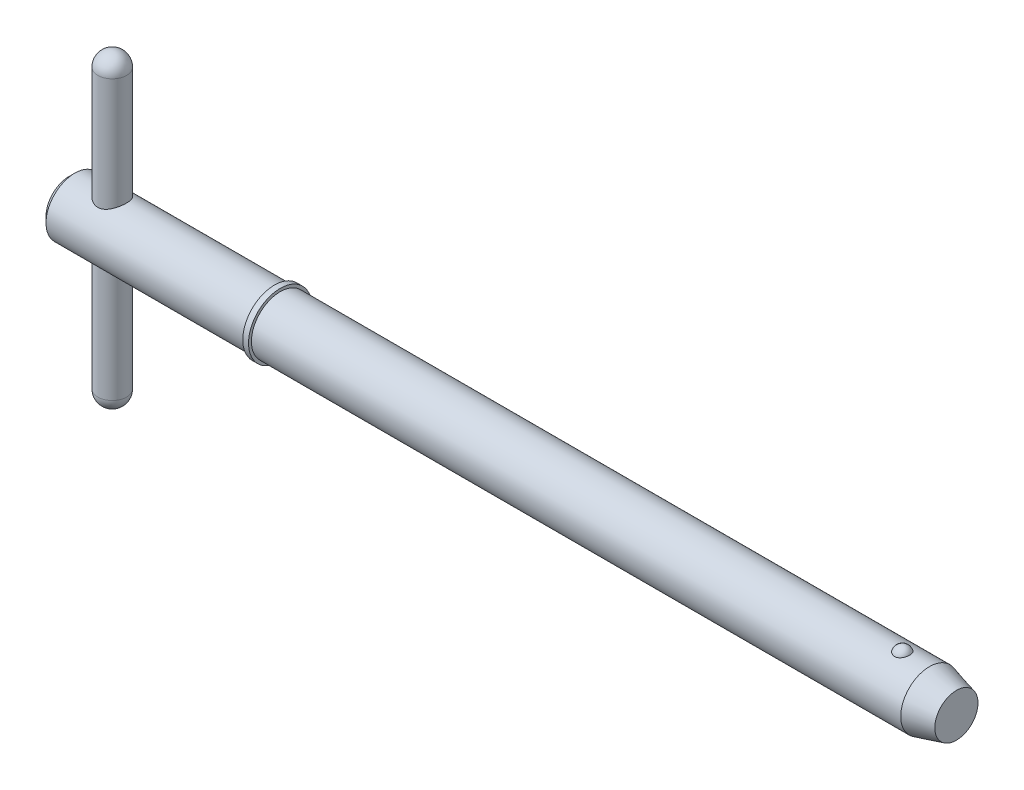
ISO-10303-21;
HEADER;
FILE_DESCRIPTION(('STEP AP214'),'2;1');
FILE_NAME('part.step','',(''),(''),'','','');
FILE_SCHEMA(('AUTOMOTIVE_DESIGN { 1 0 10303 214 1 1 1 1 }'));
ENDSEC;
DATA;
#1=APPLICATION_CONTEXT('core data for automotive mechanical design processes');
#2=APPLICATION_PROTOCOL_DEFINITION('international standard','automotive_design',2000,#1);
#3=PRODUCT_CONTEXT('',#1,'mechanical');
#4=PRODUCT('Part','Part','',(#3));
#5=PRODUCT_RELATED_PRODUCT_CATEGORY('part','',(#4));
#6=PRODUCT_DEFINITION_FORMATION('','',#4);
#7=PRODUCT_DEFINITION_CONTEXT('part definition',#1,'design');
#8=PRODUCT_DEFINITION('design','',#6,#7);
#9=PRODUCT_DEFINITION_SHAPE('','',#8);
#10=(LENGTH_UNIT() NAMED_UNIT(*) SI_UNIT(.MILLI.,.METRE.));
#11=(NAMED_UNIT(*) PLANE_ANGLE_UNIT() SI_UNIT($,.RADIAN.));
#12=(NAMED_UNIT(*) SI_UNIT($,.STERADIAN.) SOLID_ANGLE_UNIT());
#13=UNCERTAINTY_MEASURE_WITH_UNIT(LENGTH_MEASURE(1.E-05),#10,'distance_accuracy_value','');
#14=(GEOMETRIC_REPRESENTATION_CONTEXT(3) GLOBAL_UNCERTAINTY_ASSIGNED_CONTEXT((#13)) GLOBAL_UNIT_ASSIGNED_CONTEXT((#10,
#11,#12)) REPRESENTATION_CONTEXT('',''));
#15=CARTESIAN_POINT('',(0.,0.,0.));
#16=DIRECTION('',(0.,0.,1.));
#17=DIRECTION('',(1.,0.,0.));
#18=AXIS2_PLACEMENT_3D('',#15,#16,#17);
#19=CARTESIAN_POINT('',(3.57,12.7,0.));
#20=DIRECTION('',(0.,-1.,0.));
#21=DIRECTION('',(0.,0.,-1.));
#22=AXIS2_PLACEMENT_3D('',#19,#20,#21);
#23=CYLINDRICAL_SURFACE('',#22,1.19);
#24=CARTESIAN_POINT('',(3.57,-11.51,0.));
#25=DIRECTION('',(0.,-1.,0.));
#26=DIRECTION('',(0.,0.,-1.));
#27=AXIS2_PLACEMENT_3D('',#24,#25,#26);
#28=CIRCLE('',#27,1.19);
#29=CARTESIAN_POINT('',(3.57,-11.51,-1.19));
#30=VERTEX_POINT('',#29);
#31=EDGE_CURVE('P0_E10',#30,#30,#28,.F.);
#32=ORIENTED_EDGE('',*,*,#31,.T.);
#33=EDGE_LOOP('',(#32));
#34=FACE_BOUND('',#33,.T.);
#35=CARTESIAN_POINT('',(3.57,11.51,0.));
#36=DIRECTION('',(0.,-1.,0.));
#37=DIRECTION('',(0.,0.,-1.));
#38=AXIS2_PLACEMENT_3D('',#35,#36,#37);
#39=CIRCLE('',#38,1.19);
#40=CARTESIAN_POINT('',(3.57,11.51,-1.19));
#41=VERTEX_POINT('',#40);
#42=EDGE_CURVE('P0_E21',#41,#41,#39,.T.);
#43=ORIENTED_EDGE('',*,*,#42,.T.);
#44=EDGE_LOOP('',(#43));
#45=FACE_BOUND('',#44,.T.);
#46=ADVANCED_FACE('P0_F14',(#34,#45),#23,.T.);
#47=CARTESIAN_POINT('',(3.57,-11.51,0.));
#48=DIRECTION('',(0.,0.,1.));
#49=DIRECTION('',(1.,0.,0.));
#50=AXIS2_PLACEMENT_3D('',#47,#48,#49);
#51=SPHERICAL_SURFACE('',#50,1.19);
#52=CARTESIAN_POINT('',(3.57,-11.51,0.));
#53=DIRECTION('',(0.,-1.,0.));
#54=DIRECTION('',(0.,0.,-1.));
#55=AXIS2_PLACEMENT_3D('',#52,#53,#54);
#56=SPHERICAL_SURFACE('',#55,1.19);
#57=ORIENTED_EDGE('',*,*,#31,.F.);
#58=EDGE_LOOP('',(#57));
#59=FACE_BOUND('',#58,.T.);
#60=ADVANCED_FACE('P0_F29',(#59),#56,.T.);
#61=CARTESIAN_POINT('',(3.57,11.51,0.));
#62=DIRECTION('',(0.,0.,1.));
#63=DIRECTION('',(1.,0.,0.));
#64=AXIS2_PLACEMENT_3D('',#61,#62,#63);
#65=SPHERICAL_SURFACE('',#64,1.19);
#66=CARTESIAN_POINT('',(3.57,11.51,0.));
#67=DIRECTION('',(0.,-1.,0.));
#68=DIRECTION('',(0.,0.,-1.));
#69=AXIS2_PLACEMENT_3D('',#66,#67,#68);
#70=SPHERICAL_SURFACE('',#69,1.19);
#71=ORIENTED_EDGE('',*,*,#42,.F.);
#72=EDGE_LOOP('',(#71));
#73=FACE_BOUND('',#72,.T.);
#74=ADVANCED_FACE('P0_F16',(#73),#70,.T.);
#75=CLOSED_SHELL('',(#46,#60,#74));
#76=MANIFOLD_SOLID_BREP('P0_B1',#75);
#77=CARTESIAN_POINT('',(0.,0.,0.));
#78=DIRECTION('',(1.,0.,0.));
#79=DIRECTION('',(0.,0.,-1.));
#80=AXIS2_PLACEMENT_3D('',#77,#78,#79);
#81=CYLINDRICAL_SURFACE('',#80,2.38);
#82=CARTESIAN_POINT('',(71.1094297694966,0.,0.));
#83=DIRECTION('',(1.,0.,0.));
#84=DIRECTION('',(0.,0.,-1.));
#85=AXIS2_PLACEMENT_3D('',#82,#83,#84);
#86=CIRCLE('',#85,2.38);
#87=CARTESIAN_POINT('',(71.1094297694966,0.,-2.38));
#88=VERTEX_POINT('',#87);
#89=EDGE_CURVE('P1_E81',#88,#88,#86,.T.);
#90=ORIENTED_EDGE('',*,*,#89,.F.);
#91=EDGE_LOOP('',(#90));
#92=FACE_BOUND('',#91,.T.);
#93=CARTESIAN_POINT('',(17.45,0.,0.));
#94=DIRECTION('',(1.,0.,0.));
#95=DIRECTION('',(0.,0.,-1.));
#96=AXIS2_PLACEMENT_3D('',#93,#94,#95);
#97=CIRCLE('',#96,2.38);
#98=CARTESIAN_POINT('',(17.45,0.,-2.38));
#99=VERTEX_POINT('',#98);
#100=EDGE_CURVE('P1_E85',#99,#99,#97,.T.);
#101=ORIENTED_EDGE('',*,*,#100,.T.);
#102=EDGE_LOOP('',(#101));
#103=FACE_BOUND('',#102,.T.);
#104=CARTESIAN_POINT('',(68.8634492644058,2.2921568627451,0.640637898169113));
#105=CARTESIAN_POINT('',(68.8303559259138,2.29215737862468,0.64063719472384));
#106=CARTESIAN_POINT('',(68.7972546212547,2.29293179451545,0.637884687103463));
#107=CARTESIAN_POINT('',(68.7320176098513,2.29594030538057,0.626968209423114));
#108=CARTESIAN_POINT('',(68.6998823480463,2.29817506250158,0.618801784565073));
#109=CARTESIAN_POINT('',(68.6375402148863,2.3038430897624,0.597351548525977));
#110=CARTESIAN_POINT('',(68.6073305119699,2.30727454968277,0.584075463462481));
#111=CARTESIAN_POINT('',(68.5495674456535,2.31495941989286,0.552829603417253));
#112=CARTESIAN_POINT('',(68.5220141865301,2.31921286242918,0.534859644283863));
#113=CARTESIAN_POINT('',(68.4695938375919,2.32820213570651,0.494282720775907));
#114=CARTESIAN_POINT('',(68.4448050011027,2.33294694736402,0.471576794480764));
#115=CARTESIAN_POINT('',(68.3992169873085,2.34234144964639,0.422446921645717));
#116=CARTESIAN_POINT('',(68.3784185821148,2.34699112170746,0.396022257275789));
#117=CARTESIAN_POINT('',(68.3403580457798,2.35593942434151,0.338855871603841));
#118=CARTESIAN_POINT('',(68.3233051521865,2.36021170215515,0.307970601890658));
#119=CARTESIAN_POINT('',(68.2943607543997,2.3677057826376,0.243750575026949));
#120=CARTESIAN_POINT('',(68.2824701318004,2.37092740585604,0.210415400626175));
#121=CARTESIAN_POINT('',(68.2638076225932,2.37606901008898,0.141189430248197));
#122=CARTESIAN_POINT('',(68.2571956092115,2.37794816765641,0.105252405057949));
#123=CARTESIAN_POINT('',(68.2498095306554,2.38005135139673,0.032735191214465));
#124=CARTESIAN_POINT('',(68.2490358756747,2.38027526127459,-0.00384504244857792));
#125=CARTESIAN_POINT('',(68.2533628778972,2.37903842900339,-0.0769838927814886));
#126=CARTESIAN_POINT('',(68.2585202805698,2.37756141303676,-0.113538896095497));
#127=CARTESIAN_POINT('',(68.2747013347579,2.37305303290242,-0.185229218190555));
#128=CARTESIAN_POINT('',(68.2857251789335,2.37002161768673,-0.220364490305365));
#129=CARTESIAN_POINT('',(68.3133977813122,2.36273722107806,-0.288156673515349));
#130=CARTESIAN_POINT('',(68.3300389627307,2.35848588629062,-0.320816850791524));
#131=CARTESIAN_POINT('',(68.3685984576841,2.34923130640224,-0.382744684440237));
#132=CARTESIAN_POINT('',(68.390516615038,2.34422808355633,-0.412012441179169));
#133=CARTESIAN_POINT('',(68.4387549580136,2.33412555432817,-0.465830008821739));
#134=CARTESIAN_POINT('',(68.465002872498,2.32902887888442,-0.490444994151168));
#135=CARTESIAN_POINT('',(68.5214769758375,2.31926941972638,-0.534700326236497));
#136=CARTESIAN_POINT('',(68.551702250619,2.3146065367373,-0.554341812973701));
#137=CARTESIAN_POINT('',(68.6140618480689,2.30645675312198,-0.587312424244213));
#138=CARTESIAN_POINT('',(68.6460780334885,2.30293152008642,-0.600855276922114));
#139=CARTESIAN_POINT('',(68.7120795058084,2.29725171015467,-0.622220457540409));
#140=CARTESIAN_POINT('',(68.7460641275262,2.29509667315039,-0.630044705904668));
#141=CARTESIAN_POINT('',(68.813299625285,2.29249264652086,-0.639452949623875));
#142=CARTESIAN_POINT('',(68.8465087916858,2.29196755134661,-0.641315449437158));
#143=CARTESIAN_POINT('',(68.912763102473,2.29246849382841,-0.63952261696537));
#144=CARTESIAN_POINT('',(68.9458082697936,2.29349430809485,-0.635868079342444));
#145=CARTESIAN_POINT('',(69.0101025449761,2.29694059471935,-0.623301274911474));
#146=CARTESIAN_POINT('',(69.0413744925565,2.29933234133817,-0.614497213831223));
#147=CARTESIAN_POINT('',(69.1019952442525,2.30522511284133,-0.592006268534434));
#148=CARTESIAN_POINT('',(69.1313438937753,2.30872622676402,-0.578318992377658));
#149=CARTESIAN_POINT('',(69.1880369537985,2.31655795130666,-0.546112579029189));
#150=CARTESIAN_POINT('',(69.215320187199,2.32090569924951,-0.52749010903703));
#151=CARTESIAN_POINT('',(69.2664904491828,2.3299220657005,-0.486117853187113));
#152=CARTESIAN_POINT('',(69.2903767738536,2.33459075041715,-0.463367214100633));
#153=CARTESIAN_POINT('',(69.3352722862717,2.34399834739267,-0.413220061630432));
#154=CARTESIAN_POINT('',(69.3560972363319,2.34873051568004,-0.385657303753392));
#155=CARTESIAN_POINT('',(69.393056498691,2.35754932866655,-0.327455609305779));
#156=CARTESIAN_POINT('',(69.4091898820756,2.36163584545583,-0.296816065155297));
#157=CARTESIAN_POINT('',(69.4369822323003,2.36889321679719,-0.23204704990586));
#158=CARTESIAN_POINT('',(69.4484450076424,2.37202275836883,-0.197828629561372));
#159=CARTESIAN_POINT('',(69.4657523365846,2.37681926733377,-0.127900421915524));
#160=CARTESIAN_POINT('',(69.4715962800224,2.37848607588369,-0.0921904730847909));
#161=CARTESIAN_POINT('',(69.477605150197,2.38020024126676,-0.0196348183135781));
#162=CARTESIAN_POINT('',(69.4776704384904,2.38021918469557,0.0172198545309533));
#163=CARTESIAN_POINT('',(69.4718689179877,2.37856356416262,0.0904219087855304));
#164=CARTESIAN_POINT('',(69.4660018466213,2.37688892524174,0.126769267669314));
#165=CARTESIAN_POINT('',(69.448425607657,2.37201688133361,0.198028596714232));
#166=CARTESIAN_POINT('',(69.4366998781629,2.36881516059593,0.232936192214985));
#167=CARTESIAN_POINT('',(69.4076354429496,2.36123444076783,0.300196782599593));
#168=CARTESIAN_POINT('',(69.3902967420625,2.3568554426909,0.332549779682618));
#169=CARTESIAN_POINT('',(69.3505350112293,2.34744667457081,0.39349541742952));
#170=CARTESIAN_POINT('',(69.3281528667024,2.34242227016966,0.422115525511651));
#171=CARTESIAN_POINT('',(69.2787391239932,2.33227293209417,0.475004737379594));
#172=CARTESIAN_POINT('',(69.2517076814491,2.32714800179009,0.499273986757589));
#173=CARTESIAN_POINT('',(69.1944988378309,2.31755359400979,0.542046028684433));
#174=CARTESIAN_POINT('',(69.1644297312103,2.3130698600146,0.560690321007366));
#175=CARTESIAN_POINT('',(69.1013869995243,2.30514125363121,0.592447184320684));
#176=CARTESIAN_POINT('',(69.0684158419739,2.30169550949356,0.605564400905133));
#177=CARTESIAN_POINT('',(69.0068424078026,2.29677744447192,0.623927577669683));
#178=CARTESIAN_POINT('',(68.9785555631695,2.295058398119,0.630178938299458));
#179=CARTESIAN_POINT('',(68.9213308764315,2.29274795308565,0.638534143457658));
#180=CARTESIAN_POINT('',(68.8923931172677,2.29215641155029,0.640638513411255));
#181=CARTESIAN_POINT('',(68.8634492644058,2.2921568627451,0.640637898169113));
#182=B_SPLINE_CURVE_WITH_KNOTS('',3,(#104,#105,#106,#107,#108,#109,#110,#111,#112,#113,#114,
#115,#116,#117,#118,#119,#120,#121,#122,#123,#124,#125,#126,#127,#128,#129,#130,#131,#132,#133,
#134,#135,#136,#137,#138,#139,#140,#141,#142,#143,#144,#145,#146,#147,#148,#149,#150,#151,#152,
#153,#154,#155,#156,#157,#158,#159,#160,#161,#162,#163,#164,#165,#166,#167,#168,#169,#170,#171,
#172,#173,#174,#175,#176,#177,#178,#179,#180,#181),.UNSPECIFIED.,.T.,.F.,(4,2,2,2,2,2,2,2,2,2,2,
2,2,2,2,2,2,2,2,2,2,2,2,2,2,2,2,2,2,2,2,2,2,2,2,2,2,2,4),(0.,0.0991724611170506,
0.198389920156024,0.297457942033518,0.396529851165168,0.497927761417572,0.59934527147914,
0.70547553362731,0.811623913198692,0.920876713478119,1.03013718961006,1.14045177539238,
1.25076998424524,1.36093998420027,1.47110672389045,1.57959248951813,1.68805336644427,
1.79234266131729,1.89659691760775,1.9959039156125,2.09519661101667,2.19247425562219,
2.2897597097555,2.38926978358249,2.48880044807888,2.59293588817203,2.69709193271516,
2.80525821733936,2.91343624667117,3.0234791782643,3.13352698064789,3.24388765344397,
3.35424823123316,3.46374443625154,3.57323697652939,3.67968690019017,3.78604717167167,
3.87279565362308,3.9595331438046),.UNSPECIFIED.);
#183=CARTESIAN_POINT('',(68.8634492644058,2.2921568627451,0.640637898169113));
#184=VERTEX_POINT('',#183);
#185=EDGE_CURVE('P1_E35',#184,#184,#182,.T.);
#186=ORIENTED_EDGE('',*,*,#185,.T.);
#187=EDGE_LOOP('',(#186));
#188=FACE_BOUND('',#187,.T.);
#189=ADVANCED_FACE('P1_F13',(#92,#103,#188),#81,.T.);
#190=CARTESIAN_POINT('',(0.,0.,0.));
#191=DIRECTION('',(-1.,0.,0.));
#192=DIRECTION('',(0.,0.,1.));
#193=AXIS2_PLACEMENT_3D('',#190,#191,#192);
#194=PLANE('',#193);
#195=CARTESIAN_POINT('',(0.,0.,0.));
#196=DIRECTION('',(1.,0.,0.));
#197=DIRECTION('',(0.,0.,-1.));
#198=AXIS2_PLACEMENT_3D('',#195,#196,#197);
#199=CIRCLE('',#198,1.904);
#200=CARTESIAN_POINT('',(0.,0.,-1.904));
#201=VERTEX_POINT('',#200);
#202=EDGE_CURVE('P1_E9',#201,#201,#199,.T.);
#203=ORIENTED_EDGE('',*,*,#202,.F.);
#204=EDGE_LOOP('',(#203));
#205=FACE_BOUND('',#204,.T.);
#206=ADVANCED_FACE('P1_F15',(#205),#194,.T.);
#207=CARTESIAN_POINT('',(0.475999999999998,0.,0.));
#208=DIRECTION('',(1.,0.,0.));
#209=DIRECTION('',(0.,0.,-1.));
#210=AXIS2_PLACEMENT_3D('',#207,#208,#209);
#211=CONICAL_SURFACE('',#210,2.38,0.78539816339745);
#212=ORIENTED_EDGE('',*,*,#202,.T.);
#213=EDGE_LOOP('',(#212));
#214=FACE_BOUND('',#213,.T.);
#215=CARTESIAN_POINT('',(0.475999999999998,0.,0.));
#216=DIRECTION('',(1.,0.,0.));
#217=DIRECTION('',(0.,0.,-1.));
#218=AXIS2_PLACEMENT_3D('',#215,#216,#217);
#219=CIRCLE('',#218,2.38);
#220=CARTESIAN_POINT('',(0.475999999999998,0.,-2.38));
#221=VERTEX_POINT('',#220);
#222=EDGE_CURVE('P1_E26',#221,#221,#219,.T.);
#223=ORIENTED_EDGE('',*,*,#222,.F.);
#224=EDGE_LOOP('',(#223));
#225=FACE_BOUND('',#224,.T.);
#226=ADVANCED_FACE('P1_F77',(#214,#225),#211,.T.);
#227=CARTESIAN_POINT('',(0.,0.,0.));
#228=DIRECTION('',(1.,0.,0.));
#229=DIRECTION('',(0.,0.,-1.));
#230=AXIS2_PLACEMENT_3D('',#227,#228,#229);
#231=CYLINDRICAL_SURFACE('',#230,2.38);
#232=CARTESIAN_POINT('',(3.57,-2.06114046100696,1.19));
#233=CARTESIAN_POINT('',(3.50799170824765,-2.06114586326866,1.18999567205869));
#234=CARTESIAN_POINT('',(3.4459051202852,-2.0639812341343,1.18512096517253));
#235=CARTESIAN_POINT('',(3.32363755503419,-2.07491216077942,1.16587061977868));
#236=CARTESIAN_POINT('',(3.26346086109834,-2.08301876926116,1.15147501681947));
#237=CARTESIAN_POINT('',(3.14701251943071,-2.10331722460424,1.11395893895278));
#238=CARTESIAN_POINT('',(3.09072196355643,-2.1154873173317,1.09088484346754));
#239=CARTESIAN_POINT('',(2.9828251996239,-2.14250771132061,1.03680835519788));
#240=CARTESIAN_POINT('',(2.93121924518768,-2.15735815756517,1.00580553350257));
#241=CARTESIAN_POINT('',(2.82945618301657,-2.18956274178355,0.933753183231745));
#242=CARTESIAN_POINT('',(2.77976962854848,-2.20702235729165,0.892085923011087));
#243=CARTESIAN_POINT('',(2.68772401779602,-2.2416265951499,0.801172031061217));
#244=CARTESIAN_POINT('',(2.64536861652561,-2.25877105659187,0.751921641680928));
#245=CARTESIAN_POINT('',(2.56639309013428,-2.29219557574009,0.64318258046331));
#246=CARTESIAN_POINT('',(2.53035201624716,-2.30833946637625,0.583227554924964));
#247=CARTESIAN_POINT('',(2.46908238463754,-2.3365739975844,0.45714686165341));
#248=CARTESIAN_POINT('',(2.44384700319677,-2.34866719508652,0.391025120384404));
#249=CARTESIAN_POINT('',(2.40676945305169,-2.36667748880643,0.259473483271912));
#250=CARTESIAN_POINT('',(2.39410206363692,-2.37297281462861,0.194329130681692));
#251=CARTESIAN_POINT('',(2.3798023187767,-2.3800902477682,0.0625590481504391));
#252=CARTESIAN_POINT('',(2.37816328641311,-2.38091566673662,-0.00406576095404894));
#253=CARTESIAN_POINT('',(2.38564854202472,-2.37717948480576,-0.130700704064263));
#254=CARTESIAN_POINT('',(2.39384923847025,-2.37308010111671,-0.190782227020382));
#255=CARTESIAN_POINT('',(2.41912820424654,-2.360653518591,-0.308583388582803));
#256=CARTESIAN_POINT('',(2.43620713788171,-2.35232600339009,-0.366302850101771));
#257=CARTESIAN_POINT('',(2.47886825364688,-2.33206184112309,-0.478748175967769));
#258=CARTESIAN_POINT('',(2.50456481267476,-2.32007685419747,-0.533421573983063));
#259=CARTESIAN_POINT('',(2.56357346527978,-2.29357798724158,-0.637812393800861));
#260=CARTESIAN_POINT('',(2.5968882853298,-2.27906320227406,-0.687528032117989));
#261=CARTESIAN_POINT('',(2.67380546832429,-2.24724829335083,-0.785606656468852));
#262=CARTESIAN_POINT('',(2.71808260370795,-2.22981457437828,-0.833397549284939));
#263=CARTESIAN_POINT('',(2.81386177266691,-2.19500665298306,-0.921184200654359));
#264=CARTESIAN_POINT('',(2.86536931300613,-2.17763250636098,-0.961173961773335));
#265=CARTESIAN_POINT('',(2.97815134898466,-2.14371545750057,-1.03471134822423));
#266=CARTESIAN_POINT('',(3.03983836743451,-2.12729540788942,-1.06768860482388));
#267=CARTESIAN_POINT('',(3.16889582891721,-2.09886785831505,-1.12254974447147));
#268=CARTESIAN_POINT('',(3.2362602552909,-2.0868557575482,-1.14444520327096));
#269=CARTESIAN_POINT('',(3.36914526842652,-2.06994116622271,-1.1747444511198));
#270=CARTESIAN_POINT('',(3.43438893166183,-2.06455070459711,-1.18407989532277));
#271=CARTESIAN_POINT('',(3.56571759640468,-2.06010324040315,-1.1918051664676));
#272=CARTESIAN_POINT('',(3.63180197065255,-2.06104176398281,-1.19020272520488));
#273=CARTESIAN_POINT('',(3.75522816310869,-2.06862860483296,-1.17695289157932));
#274=CARTESIAN_POINT('',(3.81273554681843,-2.07464109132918,-1.16642350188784));
#275=CARTESIAN_POINT('',(3.92505766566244,-2.09075885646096,-1.1372785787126));
#276=CARTESIAN_POINT('',(3.97987152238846,-2.1008654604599,-1.1186604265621));
#277=CARTESIAN_POINT('',(4.08813948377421,-2.12458104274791,-1.07296063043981));
#278=CARTESIAN_POINT('',(4.14141303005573,-2.13833055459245,-1.04552693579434));
#279=CARTESIAN_POINT('',(4.2429084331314,-2.16765782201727,-0.983281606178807));
#280=CARTESIAN_POINT('',(4.29112767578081,-2.18323651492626,-0.948466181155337));
#281=CARTESIAN_POINT('',(4.38750473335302,-2.2168271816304,-0.867316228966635));
#282=CARTESIAN_POINT('',(4.43488860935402,-2.23489833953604,-0.82008287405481));
#283=CARTESIAN_POINT('',(4.52130056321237,-2.26973739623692,-0.718051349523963));
#284=CARTESIAN_POINT('',(4.56032581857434,-2.28650485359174,-0.663250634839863));
#285=CARTESIAN_POINT('',(4.62978273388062,-2.31742220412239,-0.545657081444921));
#286=CARTESIAN_POINT('',(4.65996041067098,-2.33149133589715,-0.482691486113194));
#287=CARTESIAN_POINT('',(4.7089941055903,-2.35481192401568,-0.351671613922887));
#288=CARTESIAN_POINT('',(4.7278600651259,-2.36406760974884,-0.283621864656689));
#289=CARTESIAN_POINT('',(4.75210859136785,-2.3760433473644,-0.151105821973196));
#290=CARTESIAN_POINT('',(4.75856947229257,-2.37928514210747,-0.0868836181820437));
#291=CARTESIAN_POINT('',(4.76100348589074,-2.38050135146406,0.0417999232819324));
#292=CARTESIAN_POINT('',(4.75698028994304,-2.37847760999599,0.106261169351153));
#293=CARTESIAN_POINT('',(4.73927447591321,-2.36969422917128,0.229120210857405));
#294=CARTESIAN_POINT('',(4.72624582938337,-2.36325544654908,0.287637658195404));
#295=CARTESIAN_POINT('',(4.69178087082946,-2.34658591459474,0.401560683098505));
#296=CARTESIAN_POINT('',(4.67034335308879,-2.33635462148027,0.456965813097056));
#297=CARTESIAN_POINT('',(4.61871480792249,-2.31247857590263,0.565753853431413));
#298=CARTESIAN_POINT('',(4.58818860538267,-2.29870654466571,0.618948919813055));
#299=CARTESIAN_POINT('',(4.51967006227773,-2.26918878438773,0.719681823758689));
#300=CARTESIAN_POINT('',(4.48167429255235,-2.25344215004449,0.76721704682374));
#301=CARTESIAN_POINT('',(4.39491140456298,-2.21969046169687,0.860267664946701));
#302=CARTESIAN_POINT('',(4.34544863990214,-2.20161660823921,0.905111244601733));
#303=CARTESIAN_POINT('',(4.23943364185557,-2.16655060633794,0.986109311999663));
#304=CARTESIAN_POINT('',(4.18287520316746,-2.1495594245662,1.02225611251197));
#305=CARTESIAN_POINT('',(4.06190239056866,-2.1181953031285,1.08579298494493));
#306=CARTESIAN_POINT('',(3.9972962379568,-2.10392207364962,1.11287022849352));
#307=CARTESIAN_POINT('',(3.86353443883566,-2.08090726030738,1.15534566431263));
#308=CARTESIAN_POINT('',(3.7943948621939,-2.07214719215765,1.17078291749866));
#309=CARTESIAN_POINT('',(3.69875162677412,-2.06499834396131,1.18329673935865));
#310=CARTESIAN_POINT('',(3.67309220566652,-2.06355673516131,1.18580656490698));
#311=CARTESIAN_POINT('',(3.62162638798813,-2.06162663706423,1.18915915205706));
#312=CARTESIAN_POINT('',(3.59581998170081,-2.0611382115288,1.19000180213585));
#313=CARTESIAN_POINT('',(3.57,-2.06114046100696,1.19));
#314=B_SPLINE_CURVE_WITH_KNOTS('',3,(#232,#233,#234,#235,#236,#237,#238,#239,#240,#241,#242,
#243,#244,#245,#246,#247,#248,#249,#250,#251,#252,#253,#254,#255,#256,#257,#258,#259,#260,#261,
#262,#263,#264,#265,#266,#267,#268,#269,#270,#271,#272,#273,#274,#275,#276,#277,#278,#279,#280,
#281,#282,#283,#284,#285,#286,#287,#288,#289,#290,#291,#292,#293,#294,#295,#296,#297,#298,#299,
#300,#301,#302,#303,#304,#305,#306,#307,#308,#309,#310,#311,#312,#313),.UNSPECIFIED.,.T.,.F.,(4,
2,2,2,2,2,2,2,2,2,2,2,2,2,2,2,2,2,2,2,2,2,2,2,2,2,2,2,2,2,2,2,2,2,2,2,2,2,2,2,4),(0.,
0.185916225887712,0.372223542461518,0.557549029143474,0.742884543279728,0.943506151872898,
1.14422749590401,1.35847891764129,1.5725948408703,1.77147547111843,1.97023568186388,
2.15171156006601,2.33320101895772,2.51720146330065,2.70126786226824,2.902733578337,
3.10435357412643,3.31877721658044,3.53297641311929,3.73020126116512,3.92728670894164,
4.1028127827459,4.27839572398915,4.46211082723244,4.64592048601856,4.8529002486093,
5.0599497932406,5.27246375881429,5.48479067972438,5.67763601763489,5.87041383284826,
6.05048865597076,6.23058930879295,6.41839293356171,6.60628297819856,6.8128718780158,
7.01964271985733,7.2329479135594,7.44553408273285,7.52294360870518,7.60035831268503),.UNSPECIFIED.);
#315=CARTESIAN_POINT('',(3.57,-2.06114046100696,1.19));
#316=VERTEX_POINT('',#315);
#317=EDGE_CURVE('P1_E17',#316,#316,#314,.T.);
#318=ORIENTED_EDGE('',*,*,#317,.F.);
#319=EDGE_LOOP('',(#318));
#320=FACE_BOUND('',#319,.T.);
#321=CARTESIAN_POINT('',(3.57,2.06114046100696,1.19));
#322=CARTESIAN_POINT('',(3.63200829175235,2.06114586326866,1.18999567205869));
#323=CARTESIAN_POINT('',(3.6940948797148,2.0639812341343,1.18512096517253));
#324=CARTESIAN_POINT('',(3.81636244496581,2.07491216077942,1.16587061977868));
#325=CARTESIAN_POINT('',(3.87653913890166,2.08301876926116,1.15147501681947));
#326=CARTESIAN_POINT('',(3.99298748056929,2.10331722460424,1.11395893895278));
#327=CARTESIAN_POINT('',(4.04927803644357,2.1154873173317,1.09088484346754));
#328=CARTESIAN_POINT('',(4.1571748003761,2.14250771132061,1.03680835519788));
#329=CARTESIAN_POINT('',(4.20878075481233,2.15735815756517,1.00580553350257));
#330=CARTESIAN_POINT('',(4.31054381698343,2.18956274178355,0.933753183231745));
#331=CARTESIAN_POINT('',(4.36023037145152,2.20702235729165,0.892085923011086));
#332=CARTESIAN_POINT('',(4.45227598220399,2.2416265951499,0.801172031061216));
#333=CARTESIAN_POINT('',(4.49463138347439,2.25877105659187,0.751921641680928));
#334=CARTESIAN_POINT('',(4.57360690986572,2.29219557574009,0.643182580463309));
#335=CARTESIAN_POINT('',(4.60964798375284,2.30833946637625,0.583227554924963));
#336=CARTESIAN_POINT('',(4.67091761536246,2.3365739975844,0.457146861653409));
#337=CARTESIAN_POINT('',(4.69615299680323,2.34866719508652,0.391025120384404));
#338=CARTESIAN_POINT('',(4.73323054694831,2.36667748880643,0.259473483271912));
#339=CARTESIAN_POINT('',(4.74589793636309,2.37297281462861,0.194329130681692));
#340=CARTESIAN_POINT('',(4.7601976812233,2.3800902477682,0.0625590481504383));
#341=CARTESIAN_POINT('',(4.76183671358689,2.38091566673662,-0.00406576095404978));
#342=CARTESIAN_POINT('',(4.75435145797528,2.37717948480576,-0.130700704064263));
#343=CARTESIAN_POINT('',(4.74615076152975,2.37308010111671,-0.190782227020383));
#344=CARTESIAN_POINT('',(4.72087179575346,2.360653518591,-0.308583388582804));
#345=CARTESIAN_POINT('',(4.70379286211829,2.35232600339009,-0.366302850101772));
#346=CARTESIAN_POINT('',(4.66113174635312,2.33206184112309,-0.478748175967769));
#347=CARTESIAN_POINT('',(4.63543518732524,2.32007685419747,-0.533421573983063));
#348=CARTESIAN_POINT('',(4.57642653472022,2.29357798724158,-0.637812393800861));
#349=CARTESIAN_POINT('',(4.5431117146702,2.27906320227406,-0.687528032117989));
#350=CARTESIAN_POINT('',(4.46619453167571,2.24724829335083,-0.785606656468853));
#351=CARTESIAN_POINT('',(4.42191739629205,2.22981457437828,-0.83339754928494));
#352=CARTESIAN_POINT('',(4.32613822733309,2.19500665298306,-0.921184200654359));
#353=CARTESIAN_POINT('',(4.27463068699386,2.17763250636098,-0.961173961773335));
#354=CARTESIAN_POINT('',(4.16184865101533,2.14371545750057,-1.03471134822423));
#355=CARTESIAN_POINT('',(4.10016163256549,2.12729540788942,-1.06768860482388));
#356=CARTESIAN_POINT('',(3.97110417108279,2.09886785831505,-1.12254974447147));
#357=CARTESIAN_POINT('',(3.9037397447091,2.0868557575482,-1.14444520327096));
#358=CARTESIAN_POINT('',(3.77085473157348,2.06994116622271,-1.1747444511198));
#359=CARTESIAN_POINT('',(3.70561106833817,2.06455070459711,-1.18407989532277));
#360=CARTESIAN_POINT('',(3.57428240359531,2.06010324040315,-1.1918051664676));
#361=CARTESIAN_POINT('',(3.50819802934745,2.06104176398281,-1.19020272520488));
#362=CARTESIAN_POINT('',(3.38477183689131,2.06862860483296,-1.17695289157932));
#363=CARTESIAN_POINT('',(3.32726445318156,2.07464109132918,-1.16642350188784));
#364=CARTESIAN_POINT('',(3.21494233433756,2.09075885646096,-1.1372785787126));
#365=CARTESIAN_POINT('',(3.16012847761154,2.1008654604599,-1.1186604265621));
#366=CARTESIAN_POINT('',(3.05186051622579,2.12458104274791,-1.07296063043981));
#367=CARTESIAN_POINT('',(2.99858696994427,2.13833055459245,-1.04552693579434));
#368=CARTESIAN_POINT('',(2.8970915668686,2.16765782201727,-0.983281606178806));
#369=CARTESIAN_POINT('',(2.84887232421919,2.18323651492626,-0.948466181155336));
#370=CARTESIAN_POINT('',(2.75249526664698,2.2168271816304,-0.867316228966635));
#371=CARTESIAN_POINT('',(2.70511139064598,2.23489833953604,-0.820082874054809));
#372=CARTESIAN_POINT('',(2.61869943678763,2.26973739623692,-0.718051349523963));
#373=CARTESIAN_POINT('',(2.57967418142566,2.28650485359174,-0.663250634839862));
#374=CARTESIAN_POINT('',(2.51021726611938,2.31742220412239,-0.54565708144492));
#375=CARTESIAN_POINT('',(2.48003958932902,2.33149133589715,-0.482691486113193));
#376=CARTESIAN_POINT('',(2.4310058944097,2.35481192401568,-0.351671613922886));
#377=CARTESIAN_POINT('',(2.4121399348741,2.36406760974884,-0.283621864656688));
#378=CARTESIAN_POINT('',(2.38789140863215,2.3760433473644,-0.151105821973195));
#379=CARTESIAN_POINT('',(2.38143052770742,2.37928514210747,-0.0868836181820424));
#380=CARTESIAN_POINT('',(2.37899651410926,2.38050135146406,0.0417999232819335));
#381=CARTESIAN_POINT('',(2.38301971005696,2.37847760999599,0.106261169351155));
#382=CARTESIAN_POINT('',(2.40072552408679,2.36969422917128,0.229120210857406));
#383=CARTESIAN_POINT('',(2.41375417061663,2.36325544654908,0.287637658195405));
#384=CARTESIAN_POINT('',(2.44821912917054,2.34658591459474,0.401560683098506));
#385=CARTESIAN_POINT('',(2.46965664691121,2.33635462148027,0.456965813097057));
#386=CARTESIAN_POINT('',(2.52128519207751,2.31247857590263,0.565753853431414));
#387=CARTESIAN_POINT('',(2.55181139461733,2.29870654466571,0.618948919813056));
#388=CARTESIAN_POINT('',(2.62032993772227,2.26918878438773,0.719681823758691));
#389=CARTESIAN_POINT('',(2.65832570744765,2.25344215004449,0.767217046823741));
#390=CARTESIAN_POINT('',(2.74508859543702,2.21969046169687,0.860267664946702));
#391=CARTESIAN_POINT('',(2.79455136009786,2.20161660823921,0.905111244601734));
#392=CARTESIAN_POINT('',(2.90056635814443,2.16655060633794,0.986109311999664));
#393=CARTESIAN_POINT('',(2.95712479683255,2.1495594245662,1.02225611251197));
#394=CARTESIAN_POINT('',(3.07809760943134,2.1181953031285,1.08579298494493));
#395=CARTESIAN_POINT('',(3.1427037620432,2.10392207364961,1.11287022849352));
#396=CARTESIAN_POINT('',(3.27646556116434,2.08090726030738,1.15534566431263));
#397=CARTESIAN_POINT('',(3.3456051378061,2.07214719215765,1.17078291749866));
#398=CARTESIAN_POINT('',(3.44124837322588,2.06499834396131,1.18329673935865));
#399=CARTESIAN_POINT('',(3.46690779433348,2.06355673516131,1.18580656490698));
#400=CARTESIAN_POINT('',(3.51837361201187,2.06162663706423,1.18915915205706));
#401=CARTESIAN_POINT('',(3.54418001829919,2.0611382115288,1.19000180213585));
#402=CARTESIAN_POINT('',(3.57,2.06114046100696,1.19));
#403=B_SPLINE_CURVE_WITH_KNOTS('',3,(#321,#322,#323,#324,#325,#326,#327,#328,#329,#330,#331,
#332,#333,#334,#335,#336,#337,#338,#339,#340,#341,#342,#343,#344,#345,#346,#347,#348,#349,#350,
#351,#352,#353,#354,#355,#356,#357,#358,#359,#360,#361,#362,#363,#364,#365,#366,#367,#368,#369,
#370,#371,#372,#373,#374,#375,#376,#377,#378,#379,#380,#381,#382,#383,#384,#385,#386,#387,#388,
#389,#390,#391,#392,#393,#394,#395,#396,#397,#398,#399,#400,#401,#402),.UNSPECIFIED.,.T.,.F.,(4,
2,2,2,2,2,2,2,2,2,2,2,2,2,2,2,2,2,2,2,2,2,2,2,2,2,2,2,2,2,2,2,2,2,2,2,2,2,2,2,4),(0.,
0.185916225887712,0.372223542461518,0.557549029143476,0.74288454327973,0.9435061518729,
1.14422749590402,1.35847891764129,1.5725948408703,1.77147547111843,1.97023568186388,
2.15171156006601,2.33320101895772,2.51720146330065,2.70126786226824,2.902733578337,
3.10435357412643,3.31877721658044,3.53297641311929,3.73020126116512,3.92728670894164,
4.1028127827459,4.27839572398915,4.46211082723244,4.64592048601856,4.8529002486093,
5.05994979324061,5.27246375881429,5.48479067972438,5.67763601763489,5.87041383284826,
6.05048865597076,6.23058930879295,6.41839293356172,6.60628297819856,6.8128718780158,
7.01964271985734,7.2329479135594,7.44553408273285,7.52294360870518,7.60035831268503),.UNSPECIFIED.);
#404=CARTESIAN_POINT('',(3.57,2.06114046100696,1.19));
#405=VERTEX_POINT('',#404);
#406=EDGE_CURVE('P1_E43',#405,#405,#403,.T.);
#407=ORIENTED_EDGE('',*,*,#406,.F.);
#408=EDGE_LOOP('',(#407));
#409=FACE_BOUND('',#408,.T.);
#410=ORIENTED_EDGE('',*,*,#222,.T.);
#411=EDGE_LOOP('',(#410));
#412=FACE_BOUND('',#411,.T.);
#413=CARTESIAN_POINT('',(16.974,0.,0.));
#414=DIRECTION('',(1.,0.,0.));
#415=DIRECTION('',(0.,0.,-1.));
#416=AXIS2_PLACEMENT_3D('',#413,#414,#415);
#417=CIRCLE('',#416,2.38);
#418=CARTESIAN_POINT('',(16.974,0.,-2.38));
#419=VERTEX_POINT('',#418);
#420=EDGE_CURVE('P1_E31',#419,#419,#417,.T.);
#421=ORIENTED_EDGE('',*,*,#420,.F.);
#422=EDGE_LOOP('',(#421));
#423=FACE_BOUND('',#422,.T.);
#424=ADVANCED_FACE('P1_F103',(#320,#409,#412,#423),#231,.T.);
#425=CARTESIAN_POINT('',(16.974,2.38,0.));
#426=DIRECTION('',(-1.,0.,0.));
#427=DIRECTION('',(0.,0.,1.));
#428=AXIS2_PLACEMENT_3D('',#425,#426,#427);
#429=PLANE('',#428);
#430=ORIENTED_EDGE('',*,*,#420,.T.);
#431=EDGE_LOOP('',(#430));
#432=FACE_BOUND('',#431,.T.);
#433=CARTESIAN_POINT('',(16.974,0.,0.));
#434=DIRECTION('',(1.,0.,0.));
#435=DIRECTION('',(0.,0.,-1.));
#436=AXIS2_PLACEMENT_3D('',#433,#434,#435);
#437=CIRCLE('',#436,2.618);
#438=CARTESIAN_POINT('',(16.974,0.,-2.618));
#439=VERTEX_POINT('',#438);
#440=EDGE_CURVE('P1_E91',#439,#439,#437,.T.);
#441=ORIENTED_EDGE('',*,*,#440,.F.);
#442=EDGE_LOOP('',(#441));
#443=FACE_BOUND('',#442,.T.);
#444=ADVANCED_FACE('P1_F100',(#432,#443),#429,.T.);
#445=CARTESIAN_POINT('',(0.,0.,0.));
#446=DIRECTION('',(1.,0.,0.));
#447=DIRECTION('',(0.,0.,-1.));
#448=AXIS2_PLACEMENT_3D('',#445,#446,#447);
#449=CYLINDRICAL_SURFACE('',#448,2.618);
#450=ORIENTED_EDGE('',*,*,#440,.T.);
#451=EDGE_LOOP('',(#450));
#452=FACE_BOUND('',#451,.T.);
#453=CARTESIAN_POINT('',(17.45,0.,0.));
#454=DIRECTION('',(1.,0.,0.));
#455=DIRECTION('',(0.,0.,-1.));
#456=AXIS2_PLACEMENT_3D('',#453,#454,#455);
#457=CIRCLE('',#456,2.618);
#458=CARTESIAN_POINT('',(17.45,0.,-2.618));
#459=VERTEX_POINT('',#458);
#460=EDGE_CURVE('P1_E88',#459,#459,#457,.T.);
#461=ORIENTED_EDGE('',*,*,#460,.F.);
#462=EDGE_LOOP('',(#461));
#463=FACE_BOUND('',#462,.T.);
#464=ADVANCED_FACE('P1_F68',(#452,#463),#449,.T.);
#465=CARTESIAN_POINT('',(17.45,2.618,0.));
#466=DIRECTION('',(1.,0.,0.));
#467=DIRECTION('',(0.,0.,-1.));
#468=AXIS2_PLACEMENT_3D('',#465,#466,#467);
#469=PLANE('',#468);
#470=ORIENTED_EDGE('',*,*,#460,.T.);
#471=EDGE_LOOP('',(#470));
#472=FACE_BOUND('',#471,.T.);
#473=ORIENTED_EDGE('',*,*,#100,.F.);
#474=EDGE_LOOP('',(#473));
#475=FACE_BOUND('',#474,.T.);
#476=ADVANCED_FACE('P1_F62',(#472,#475),#469,.T.);
#477=CARTESIAN_POINT('',(73.33,0.,0.));
#478=DIRECTION('',(-1.,0.,0.));
#479=DIRECTION('',(0.,0.,1.));
#480=AXIS2_PLACEMENT_3D('',#477,#478,#479);
#481=CONICAL_SURFACE('',#480,1.78500000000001,0.26179938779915);
#482=ORIENTED_EDGE('',*,*,#89,.T.);
#483=EDGE_LOOP('',(#482));
#484=FACE_BOUND('',#483,.T.);
#485=CARTESIAN_POINT('',(73.33,0.,0.));
#486=DIRECTION('',(1.,0.,0.));
#487=DIRECTION('',(0.,0.,-1.));
#488=AXIS2_PLACEMENT_3D('',#485,#486,#487);
#489=CIRCLE('',#488,1.78500000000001);
#490=CARTESIAN_POINT('',(73.33,0.,-1.78500000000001));
#491=VERTEX_POINT('',#490);
#492=EDGE_CURVE('P1_E42',#491,#491,#489,.T.);
#493=ORIENTED_EDGE('',*,*,#492,.F.);
#494=EDGE_LOOP('',(#493));
#495=FACE_BOUND('',#494,.T.);
#496=ADVANCED_FACE('P1_F59',(#484,#495),#481,.T.);
#497=CARTESIAN_POINT('',(73.33,1.78500000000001,0.));
#498=DIRECTION('',(1.,0.,0.));
#499=DIRECTION('',(0.,0.,-1.));
#500=AXIS2_PLACEMENT_3D('',#497,#498,#499);
#501=PLANE('',#500);
#502=ORIENTED_EDGE('',*,*,#492,.T.);
#503=EDGE_LOOP('',(#502));
#504=FACE_BOUND('',#503,.T.);
#505=ADVANCED_FACE('P1_F55',(#504),#501,.T.);
#506=CARTESIAN_POINT('',(68.8634492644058,2.142,0.));
#507=DIRECTION('',(-1.,0.,0.));
#508=DIRECTION('',(0.,1.,0.));
#509=AXIS2_PLACEMENT_3D('',#506,#507,#508);
#510=SPHERICAL_SURFACE('',#509,0.657999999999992);
#511=ORIENTED_EDGE('',*,*,#185,.F.);
#512=EDGE_LOOP('',(#511));
#513=FACE_BOUND('',#512,.T.);
#514=ADVANCED_FACE('P1_F50',(#513),#510,.T.);
#515=CARTESIAN_POINT('',(3.57,-2.618,0.));
#516=DIRECTION('',(0.,1.,0.));
#517=DIRECTION('',(0.,0.,1.));
#518=AXIS2_PLACEMENT_3D('',#515,#516,#517);
#519=CYLINDRICAL_SURFACE('',#518,1.19);
#520=ORIENTED_EDGE('',*,*,#317,.T.);
#521=EDGE_LOOP('',(#520));
#522=FACE_BOUND('',#521,.T.);
#523=ORIENTED_EDGE('',*,*,#406,.T.);
#524=EDGE_LOOP('',(#523));
#525=FACE_BOUND('',#524,.T.);
#526=ADVANCED_FACE('P1_F54',(#522,#525),#519,.F.);
#527=CLOSED_SHELL('',(#189,#206,#226,#424,#444,#464,#476,#496,#505,#514,#526));
#528=MANIFOLD_SOLID_BREP('P1_B1',#527);
#529=ADVANCED_BREP_SHAPE_REPRESENTATION('',(#18,#76,#528),#14);
#530=SHAPE_DEFINITION_REPRESENTATION(#9,#529);
ENDSEC;
END-ISO-10303-21;
